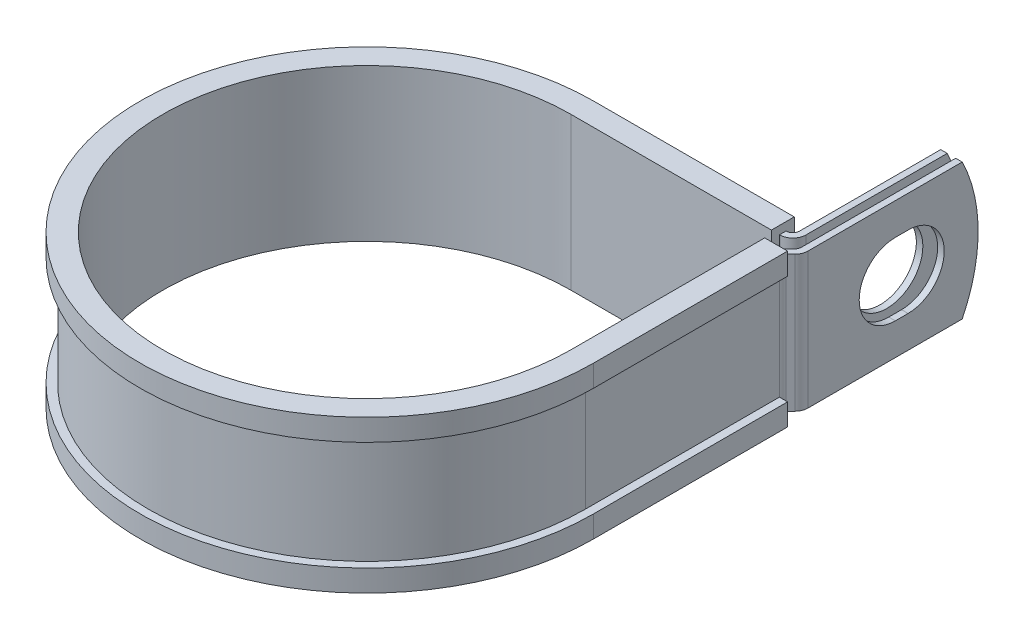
from build123d import *

# Parameters (mm, degrees)
EXTRUDE_THIN1_DEPTH = 12.7
SKETCH2_R           = 6.7437
CUT_EXTRUDE1_DEPTH  = 1.2192
CUT_EXTRUDE2_DEPTH  = 1.2192
CUT_EXTRUDE3_DEPTH  = 108.676754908


with BuildPart() as part:
    # Sketch1 → Extrude-Thin1 (new, symmetric)
    with BuildSketch(Plane(origin=(0, 0, 0), x_dir=(1, 0, 0), z_dir=(0, 1, 0))):
        with BuildLine():
            Line((41.5214698, 71.4248), (41.5214698, 39.624))
            ThreePointArc((41.5214698, 39.624), (41.428663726, 39.157432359), (41.164374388, 38.761895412))
            Line((41.164374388, 38.761895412), (40.338190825, 37.935711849))
            ThreePointArc((40.338190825, 37.935711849), (39.809612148, 37.144637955), (39.624, 36.211502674))
            Line((39.624, 36.211502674), (39.624, 0))
            ThreePointArc((39.624, 0), (-28.018399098, -28.018399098), (0, 39.624))
            Line((0, 39.624), (37.5082698, 39.624))
            ThreePointArc((37.5082698, 39.624), (39.232478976, 40.338190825), (39.9466698, 42.0624))
            Line((39.9466698, 42.0624), (39.9466698, 71.4248))
            Line((39.9466698, 71.4248), (38.7274698, 71.4248))
            Line((38.7274698, 71.4248), (38.7274698, 42.0624))
            ThreePointArc((38.7274698, 42.0624), (38.370374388, 41.200295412), (37.5082698, 40.8432))
            Line((37.5082698, 40.8432), (0, 40.8432))
            ThreePointArc((0, 40.8432), (-28.880503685, -28.880503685), (40.8432, 0))
            Line((40.8432, 0), (40.8432, 36.211502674))
            ThreePointArc((40.8432, 36.211502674), (40.936006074, 36.678070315), (41.200295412, 37.073607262))
            Line((41.200295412, 37.073607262), (42.026478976, 37.899790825))
            ThreePointArc((42.026478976, 37.899790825), (42.555057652, 38.690864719), (42.7406698, 39.624))
            Line((42.7406698, 39.624), (42.7406698, 71.4248))
            Line((42.7406698, 71.4248), (41.5214698, 71.4248))
        make_face()
    extrude(amount=EXTRUDE_THIN1_DEPTH, both=True)

    # Sketch2 → Cut-Extrude1 (cut)
    with BuildSketch(Plane.ZY.offset(-38.7274698)):
        with Locations((-57.15, 0)):
            Circle(SKETCH2_R)
    extrude(amount=-CUT_EXTRUDE1_DEPTH, mode=Mode.SUBTRACT)

    # Sketch3 → Cut-Extrude2 (cut)
    with BuildSketch(Plane(origin=(42.7406698, 0, 0), x_dir=(0, 0, -1), z_dir=(1, 0, 0))):
        with BuildLine():
            Line((55.9562, 6.7437), (58.3438, 6.7437))
            ThreePointArc((58.3438, 6.7437), (65.0875, 0), (58.3438, -6.7437))
            Line((58.3438, -6.7437), (55.9562, -6.7437))
            ThreePointArc((55.9562, -6.7437), (49.2125, 0), (55.9562, 6.7437))
        make_face()
    extrude(amount=-CUT_EXTRUDE2_DEPTH, mode=Mode.SUBTRACT)

    # Sketch4 → Cut-Extrude3 (cut, through all)
    with BuildSketch(Plane.ZY.offset(-38.7274698)):
        with BuildLine():
            Line((-68.447468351, 12.7), (-71.4248, 12.7))
            Line((-71.4248, 12.7), (-71.4248, 0))
            ThreePointArc((-71.4248, 0), (-70.670511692, 6.522164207), (-68.447468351, 12.7))
        make_face()
        with BuildLine():
            ThreePointArc((-68.447468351, -12.7), (-70.670511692, -6.522164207), (-71.4248, 0))
            Line((-71.4248, 0), (-71.4248, -12.7))
            Line((-71.4248, -12.7), (-68.447468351, -12.7))
        make_face()
    extrude(amount=-CUT_EXTRUDE3_DEPTH, mode=Mode.SUBTRACT)

    # Sweep1: sweep along a path in Sketch6
    with BuildLine(Plane(origin=(0, 12.7, 0), x_dir=(1, 0, 0), z_dir=(0, 1, 0))) as sweep1_path:
        Line((38.1, 36.211502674), (38.1, 0))
        ThreePointArc((38.1, 0), (-26.940768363, -26.940768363), (0, 38.1))
        Line((0, 38.1), (37.4574698, 38.1))
    # Sketch5 → Sweep1 (sweep)
    with BuildSketch(Plane(origin=(0, 0, -36.211502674), x_dir=(-1, 0, 0), z_dir=(0, 0, -1))):
        Polygon((-40.8432, 12.7), (-39.624, 12.7), (-39.624, -12.7), (-40.8432, -12.7), (-40.8432, -10.16), (-42.3672, -10.16), (-42.3672, -14.224), (-38.1, -14.224), (-38.1, 14.224), (-42.3672, 14.224), (-42.3672, 10.16), (-40.8432, 10.16), align=None)
    sweep(path=sweep1_path.line)


solid = part.part
